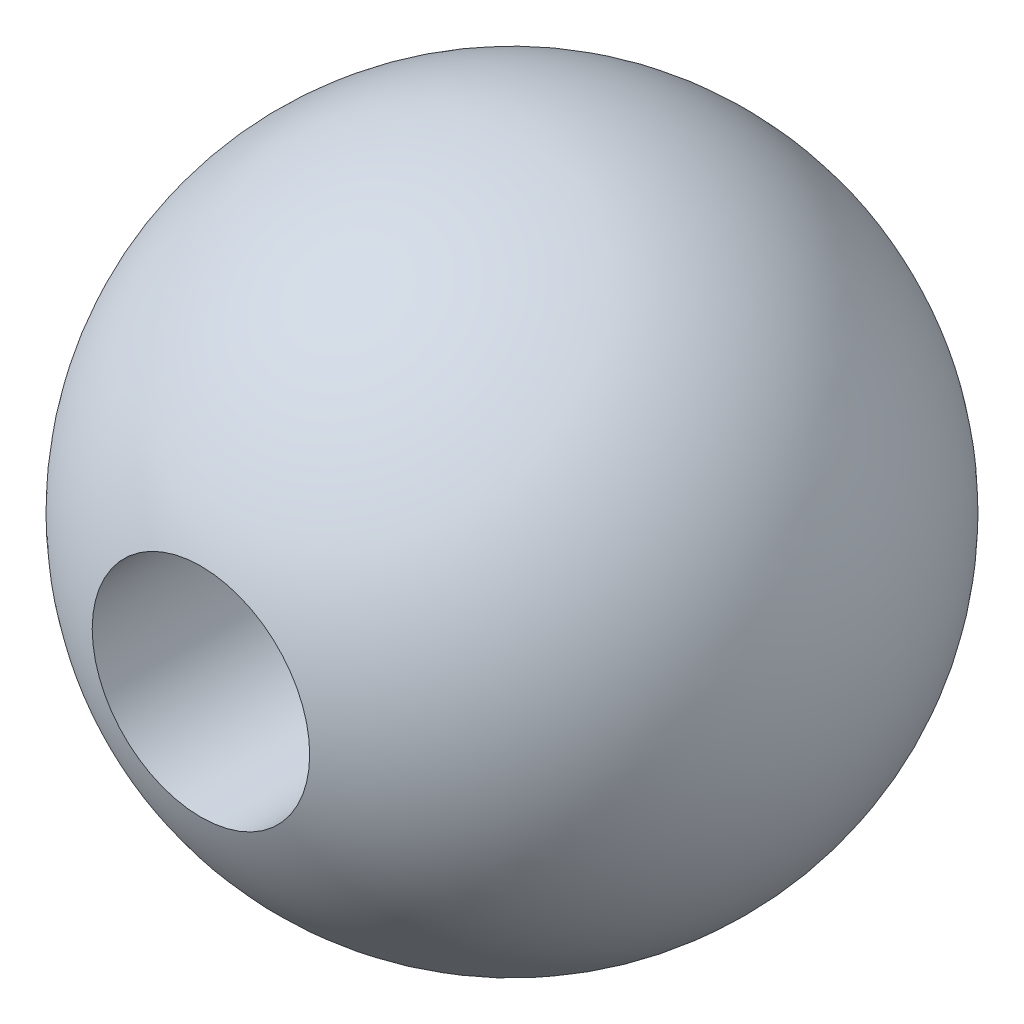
ISO-10303-21;
HEADER;
FILE_DESCRIPTION(('STEP AP214'),'2;1');
FILE_NAME('part.step','',(''),(''),'','','');
FILE_SCHEMA(('AUTOMOTIVE_DESIGN { 1 0 10303 214 1 1 1 1 }'));
ENDSEC;
DATA;
#1=APPLICATION_CONTEXT('core data for automotive mechanical design processes');
#2=APPLICATION_PROTOCOL_DEFINITION('international standard','automotive_design',2000,#1);
#3=PRODUCT_CONTEXT('',#1,'mechanical');
#4=PRODUCT('Part','Part','',(#3));
#5=PRODUCT_RELATED_PRODUCT_CATEGORY('part','',(#4));
#6=PRODUCT_DEFINITION_FORMATION('','',#4);
#7=PRODUCT_DEFINITION_CONTEXT('part definition',#1,'design');
#8=PRODUCT_DEFINITION('design','',#6,#7);
#9=PRODUCT_DEFINITION_SHAPE('','',#8);
#10=(LENGTH_UNIT() NAMED_UNIT(*) SI_UNIT(.MILLI.,.METRE.));
#11=(NAMED_UNIT(*) PLANE_ANGLE_UNIT() SI_UNIT($,.RADIAN.));
#12=(NAMED_UNIT(*) SI_UNIT($,.STERADIAN.) SOLID_ANGLE_UNIT());
#13=UNCERTAINTY_MEASURE_WITH_UNIT(LENGTH_MEASURE(1.E-05),#10,'distance_accuracy_value','');
#14=(GEOMETRIC_REPRESENTATION_CONTEXT(3) GLOBAL_UNCERTAINTY_ASSIGNED_CONTEXT((#13)) GLOBAL_UNIT_ASSIGNED_CONTEXT((#10,
#11,#12)) REPRESENTATION_CONTEXT('',''));
#15=CARTESIAN_POINT('',(0.,0.,0.));
#16=DIRECTION('',(0.,0.,1.));
#17=DIRECTION('',(1.,0.,0.));
#18=AXIS2_PLACEMENT_3D('',#15,#16,#17);
#19=CARTESIAN_POINT('',(0.,0.,0.));
#20=DIRECTION('',(-1.,0.,0.));
#21=DIRECTION('',(0.,1.,0.));
#22=AXIS2_PLACEMENT_3D('',#19,#20,#21);
#23=SPHERICAL_SURFACE('',#22,5.);
#24=CARTESIAN_POINT('',(0.,0.,0.));
#25=DIRECTION('',(0.,0.,-1.));
#26=DIRECTION('',(-1.,0.,0.));
#27=AXIS2_PLACEMENT_3D('',#24,#25,#26);
#28=SPHERICAL_SURFACE('',#27,5.);
#29=CARTESIAN_POINT('',(0.,0.,4.71990466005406));
#30=DIRECTION('',(0.,0.,-1.));
#31=DIRECTION('',(-1.,0.,0.));
#32=AXIS2_PLACEMENT_3D('',#29,#30,#31);
#33=CIRCLE('',#32,1.64999999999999);
#34=CARTESIAN_POINT('',(-1.64999999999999,0.,4.71990466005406));
#35=VERTEX_POINT('',#34);
#36=EDGE_CURVE('E11',#35,#35,#33,.T.);
#37=ORIENTED_EDGE('',*,*,#36,.T.);
#38=EDGE_LOOP('',(#37));
#39=FACE_BOUND('',#38,.T.);
#40=ADVANCED_FACE('F40',(#39),#28,.T.);
#41=CARTESIAN_POINT('',(0.,0.,5.));
#42=DIRECTION('',(0.,0.,1.));
#43=DIRECTION('',(1.,0.,0.));
#44=AXIS2_PLACEMENT_3D('',#41,#42,#43);
#45=CYLINDRICAL_SURFACE('',#44,1.64999999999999);
#46=CARTESIAN_POINT('',(0.,0.,-2.00857997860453));
#47=DIRECTION('',(0.,0.,1.));
#48=DIRECTION('',(1.,0.,0.));
#49=AXIS2_PLACEMENT_3D('',#46,#47,#48);
#50=CIRCLE('',#49,1.65);
#51=CARTESIAN_POINT('',(1.65,0.,-2.00857997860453));
#52=VERTEX_POINT('',#51);
#53=EDGE_CURVE('E46',#52,#52,#50,.T.);
#54=ORIENTED_EDGE('',*,*,#53,.F.);
#55=EDGE_LOOP('',(#54));
#56=FACE_BOUND('',#55,.T.);
#57=ORIENTED_EDGE('',*,*,#36,.F.);
#58=EDGE_LOOP('',(#57));
#59=FACE_BOUND('',#58,.T.);
#60=ADVANCED_FACE('F52',(#56,#59),#45,.F.);
#61=CARTESIAN_POINT('',(0.,0.,-2.00857997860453));
#62=DIRECTION('',(0.,0.,1.));
#63=DIRECTION('',(1.,0.,0.));
#64=AXIS2_PLACEMENT_3D('',#61,#62,#63);
#65=CONICAL_SURFACE('',#64,1.65,1.02974425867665);
#66=CARTESIAN_POINT('',(0.,0.,-3.));
#67=VERTEX_POINT('',#66);
#68=VERTEX_LOOP('',#67);
#69=FACE_BOUND('',#68,.T.);
#70=ORIENTED_EDGE('',*,*,#53,.T.);
#71=EDGE_LOOP('',(#70));
#72=FACE_BOUND('',#71,.T.);
#73=ADVANCED_FACE('F49',(#69,#72),#65,.F.);
#74=CLOSED_SHELL('',(#40,#60,#73));
#75=MANIFOLD_SOLID_BREP('B2',#74);
#76=ADVANCED_BREP_SHAPE_REPRESENTATION('',(#18,#75),#14);
#77=SHAPE_DEFINITION_REPRESENTATION(#9,#76);
ENDSEC;
END-ISO-10303-21;
